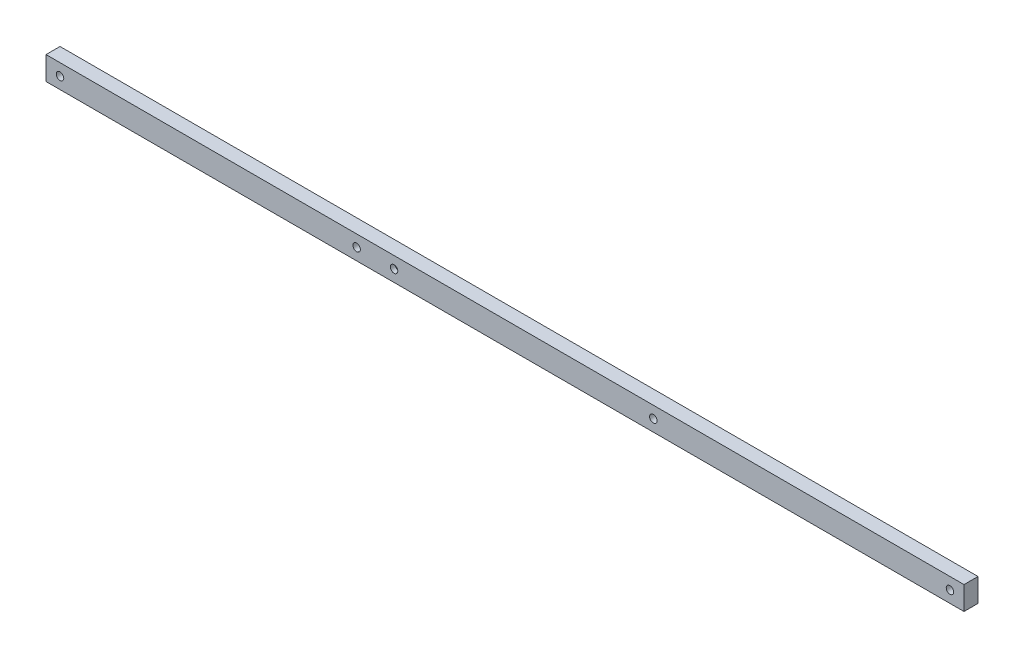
from build123d import *

# Parameters (mm, degrees)
ESQUISSE1_W             = 393
ESQUISSE1_H             = 10
ESQUISSE1_R             = 1.6
EXTRUSION1_DEPTH        = 6
ESQUISSE2_R             = 1.6
ENL_V_MAT_EXTRU_1_DEPTH = 2


with BuildPart() as part:
    # Esquisse1 → Extrusion1 (new body)
    with BuildSketch(Plane.XY):
        with Locations((196.5, 5)):
            Rectangle(ESQUISSE1_W, ESQUISSE1_H)
        with Locations((6, 5)):
            Circle(ESQUISSE1_R, mode=Mode.SUBTRACT)
        with Locations((133, 5)):
            Circle(ESQUISSE1_R, mode=Mode.SUBTRACT)
        with Locations((260, 5)):
            Circle(ESQUISSE1_R, mode=Mode.SUBTRACT)
        with Locations((387, 5)):
            Circle(ESQUISSE1_R, mode=Mode.SUBTRACT)
    extrude(amount=EXTRUSION1_DEPTH)

    # Esquisse2 → Enl_v. mat.-Extru.1 (cut)
    with BuildSketch(Plane.XY.offset(6)):
        with Locations((149, 5)):
            Circle(ESQUISSE2_R)
    extrude(amount=-ENL_V_MAT_EXTRU_1_DEPTH, mode=Mode.SUBTRACT)


solid = part.part
